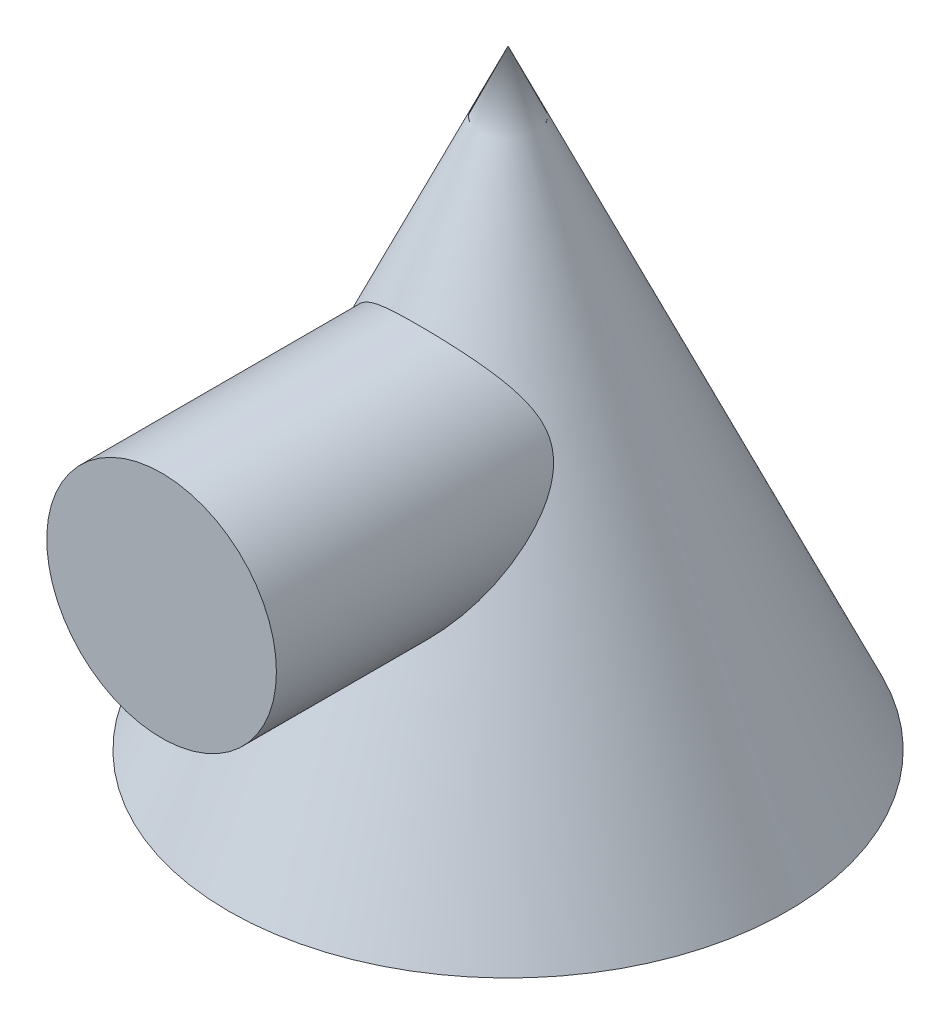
ISO-10303-21;
HEADER;
FILE_DESCRIPTION(('STEP AP214'),'2;1');
FILE_NAME('part.step','',(''),(''),'','','');
FILE_SCHEMA(('AUTOMOTIVE_DESIGN { 1 0 10303 214 1 1 1 1 }'));
ENDSEC;
DATA;
#1=APPLICATION_CONTEXT('core data for automotive mechanical design processes');
#2=APPLICATION_PROTOCOL_DEFINITION('international standard','automotive_design',2000,#1);
#3=PRODUCT_CONTEXT('',#1,'mechanical');
#4=PRODUCT('Part','Part','',(#3));
#5=PRODUCT_RELATED_PRODUCT_CATEGORY('part','',(#4));
#6=PRODUCT_DEFINITION_FORMATION('','',#4);
#7=PRODUCT_DEFINITION_CONTEXT('part definition',#1,'design');
#8=PRODUCT_DEFINITION('design','',#6,#7);
#9=PRODUCT_DEFINITION_SHAPE('','',#8);
#10=(LENGTH_UNIT() NAMED_UNIT(*) SI_UNIT(.MILLI.,.METRE.));
#11=(NAMED_UNIT(*) PLANE_ANGLE_UNIT() SI_UNIT($,.RADIAN.));
#12=(NAMED_UNIT(*) SI_UNIT($,.STERADIAN.) SOLID_ANGLE_UNIT());
#13=UNCERTAINTY_MEASURE_WITH_UNIT(LENGTH_MEASURE(1.E-05),#10,'distance_accuracy_value','');
#14=(GEOMETRIC_REPRESENTATION_CONTEXT(3) GLOBAL_UNCERTAINTY_ASSIGNED_CONTEXT((#13)) GLOBAL_UNIT_ASSIGNED_CONTEXT((#10,
#11,#12)) REPRESENTATION_CONTEXT('',''));
#15=CARTESIAN_POINT('',(0.,0.,0.));
#16=DIRECTION('',(0.,0.,1.));
#17=DIRECTION('',(1.,0.,0.));
#18=AXIS2_PLACEMENT_3D('',#15,#16,#17);
#19=CARTESIAN_POINT('',(0.,41.1300607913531,0.));
#20=DIRECTION('',(0.,-1.,0.));
#21=DIRECTION('',(0.,0.,-1.));
#22=AXIS2_PLACEMENT_3D('',#19,#20,#21);
#23=CONICAL_SURFACE('',#22,0.,0.429775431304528);
#24=CARTESIAN_POINT('',(0.,41.1300607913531,0.));
#25=VERTEX_POINT('',#24);
#26=VERTEX_LOOP('',#25);
#27=FACE_BOUND('',#26,.T.);
#28=CARTESIAN_POINT('',(0.,-13.4134997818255,0.));
#29=DIRECTION('',(0.,1.,0.));
#30=DIRECTION('',(0.,0.,1.));
#31=AXIS2_PLACEMENT_3D('',#28,#29,#30);
#32=CIRCLE('',#31,25.);
#33=CARTESIAN_POINT('',(0.,-13.4134997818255,25.));
#34=VERTEX_POINT('',#33);
#35=EDGE_CURVE('E11',#34,#34,#32,.T.);
#36=ORIENTED_EDGE('',*,*,#35,.T.);
#37=EDGE_LOOP('',(#36));
#38=FACE_BOUND('',#37,.T.);
#39=CARTESIAN_POINT('',(-8.7449974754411,7.88138757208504,12.4806855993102));
#40=CARTESIAN_POINT('',(-8.91898274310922,8.16349470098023,12.2008907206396));
#41=CARTESIAN_POINT('',(-9.07772798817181,8.45139461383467,11.917501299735));
#42=CARTESIAN_POINT('',(-9.3657162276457,9.03761077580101,11.346298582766));
#43=CARTESIAN_POINT('',(-9.49494629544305,9.33593152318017,11.0584834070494));
#44=CARTESIAN_POINT('',(-9.72449222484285,9.94265277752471,10.48097027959));
#45=CARTESIAN_POINT('',(-9.82476298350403,10.2510681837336,10.1912701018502));
#46=CARTESIAN_POINT('',(-9.99606661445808,10.8774010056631,9.6136618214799));
#47=CARTESIAN_POINT('',(-10.0671099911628,11.1953149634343,9.32575311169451));
#48=CARTESIAN_POINT('',(-10.1607347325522,11.7349715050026,8.84958690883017));
#49=CARTESIAN_POINT('',(-10.1915708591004,11.9539052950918,8.65973776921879));
#50=CARTESIAN_POINT('',(-10.2392386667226,12.3968255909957,8.28423786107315));
#51=CARTESIAN_POINT('',(-10.2560725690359,12.6208112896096,8.09858643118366));
#52=CARTESIAN_POINT('',(-10.2749396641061,13.074302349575,7.73373609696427));
#53=CARTESIAN_POINT('',(-10.276985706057,13.3038027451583,7.55453172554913));
#54=CARTESIAN_POINT('',(-10.2651206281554,13.7693187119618,7.20537501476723));
#55=CARTESIAN_POINT('',(-10.2512153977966,14.0053318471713,7.03541928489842));
#56=CARTESIAN_POINT('',(-10.2137542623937,14.4001120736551,6.76672232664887));
#57=CARTESIAN_POINT('',(-10.19535066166,14.5566783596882,6.66405276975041));
#58=CARTESIAN_POINT('',(-10.1505514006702,14.8731625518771,6.46594749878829));
#59=CARTESIAN_POINT('',(-10.1241547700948,15.0330808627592,6.37051266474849));
#60=CARTESIAN_POINT('',(-10.0319274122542,15.5177988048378,6.09818077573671));
#61=CARTESIAN_POINT('',(-9.95298952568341,15.8483738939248,5.93468221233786));
#62=CARTESIAN_POINT('',(-9.81586728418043,16.3127908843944,5.7479987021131));
#63=CARTESIAN_POINT('',(-9.77492610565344,16.4421782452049,5.70048021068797));
#64=CARTESIAN_POINT('',(-9.68688781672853,16.7019825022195,5.61498785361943));
#65=CARTESIAN_POINT('',(-9.63979393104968,16.8323988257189,5.57700901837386));
#66=CARTESIAN_POINT('',(-9.53945802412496,17.0932772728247,5.51165751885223));
#67=CARTESIAN_POINT('',(-9.48622628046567,17.2237389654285,5.48426744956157));
#68=CARTESIAN_POINT('',(-9.37368273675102,17.4839127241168,5.44064464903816));
#69=CARTESIAN_POINT('',(-9.31437101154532,17.6136247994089,5.4244117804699));
#70=CARTESIAN_POINT('',(-9.1899809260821,17.8712260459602,5.40320424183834));
#71=CARTESIAN_POINT('',(-9.12490106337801,17.9991147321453,5.39823251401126));
#72=CARTESIAN_POINT('',(-8.98945655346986,18.2520094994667,5.39907171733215));
#73=CARTESIAN_POINT('',(-8.91909172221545,18.3770154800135,5.40488302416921));
#74=CARTESIAN_POINT('',(-8.77344705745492,18.6235833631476,5.42633720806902));
#75=CARTESIAN_POINT('',(-8.69815744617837,18.7451376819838,5.44200021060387));
#76=CARTESIAN_POINT('',(-8.54325466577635,18.9840329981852,5.48189657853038));
#77=CARTESIAN_POINT('',(-8.46363987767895,19.1013723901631,5.50613317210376));
#78=CARTESIAN_POINT('',(-8.24772940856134,19.4059578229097,5.57977380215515));
#79=CARTESIAN_POINT('',(-8.10807161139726,19.5893442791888,5.63531779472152));
#80=CARTESIAN_POINT('',(-7.81926391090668,19.9436508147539,5.75989771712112));
#81=CARTESIAN_POINT('',(-7.67010671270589,20.1145610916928,5.828944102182));
#82=CARTESIAN_POINT('',(-7.36245236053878,20.444693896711,5.97573195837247));
#83=CARTESIAN_POINT('',(-7.20393023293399,20.6038823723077,6.05349722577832));
#84=CARTESIAN_POINT('',(-6.87814072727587,20.9104516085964,6.21356539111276));
#85=CARTESIAN_POINT('',(-6.71087544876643,21.0578351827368,6.29586719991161));
#86=CARTESIAN_POINT('',(-6.35024400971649,21.3554146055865,6.4702316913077));
#87=CARTESIAN_POINT('',(-6.15594643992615,21.504396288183,6.5624419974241));
#88=CARTESIAN_POINT('',(-5.75664518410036,21.7884897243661,6.74512372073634));
#89=CARTESIAN_POINT('',(-5.55164040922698,21.9236000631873,6.83559495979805));
#90=CARTESIAN_POINT('',(-5.1313602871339,22.1793678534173,7.011758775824));
#91=CARTESIAN_POINT('',(-4.916103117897,22.3000496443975,7.09745926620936));
#92=CARTESIAN_POINT('',(-4.47528149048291,22.5265553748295,7.26171768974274));
#93=CARTESIAN_POINT('',(-4.24971808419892,22.6323808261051,7.34027634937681));
#94=CARTESIAN_POINT('',(-3.80478364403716,22.8215080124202,7.48287625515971));
#95=CARTESIAN_POINT('',(-3.58606209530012,22.9058609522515,7.54754560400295));
#96=CARTESIAN_POINT('',(-3.14093734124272,23.0600765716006,7.66706614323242));
#97=CARTESIAN_POINT('',(-2.91453442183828,23.1299397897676,7.7219176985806));
#98=CARTESIAN_POINT('',(-2.45518584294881,23.2542932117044,7.82031291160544));
#99=CARTESIAN_POINT('',(-2.22224197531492,23.3087875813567,7.86385963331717));
#100=CARTESIAN_POINT('',(-1.75116752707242,23.4016279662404,7.93842984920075));
#101=CARTESIAN_POINT('',(-1.51303700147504,23.4399741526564,7.96945347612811));
#102=CARTESIAN_POINT('',(-1.03206232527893,23.500037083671,8.01818063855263));
#103=CARTESIAN_POINT('',(-0.789200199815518,23.5216670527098,8.03581465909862));
#104=CARTESIAN_POINT('',(-0.301931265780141,23.5475770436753,8.05694922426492));
#105=CARTESIAN_POINT('',(-0.0575244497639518,23.5518569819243,8.06044970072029));
#106=CARTESIAN_POINT('',(0.430730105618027,23.5429875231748,8.05320732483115));
#107=CARTESIAN_POINT('',(0.674577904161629,23.5298400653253,8.0424660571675));
#108=CARTESIAN_POINT('',(1.15970351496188,23.4863617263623,8.00707935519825));
#109=CARTESIAN_POINT('',(1.40098140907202,23.4560313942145,7.98243436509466));
#110=CARTESIAN_POINT('',(1.86063824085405,23.381708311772,7.92241072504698));
#111=CARTESIAN_POINT('',(2.07934731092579,23.3389506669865,7.88800727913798));
#112=CARTESIAN_POINT('',(2.51172654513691,23.2398416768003,7.8088730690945));
#113=CARTESIAN_POINT('',(2.7253970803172,23.1834913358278,7.76414306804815));
#114=CARTESIAN_POINT('',(3.14678815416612,23.0578339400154,7.66539795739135));
#115=CARTESIAN_POINT('',(3.35450593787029,22.9885209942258,7.61137862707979));
#116=CARTESIAN_POINT('',(3.76314690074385,22.8376384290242,7.49529615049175));
#117=CARTESIAN_POINT('',(3.96406862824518,22.7560662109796,7.43323129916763));
#118=CARTESIAN_POINT('',(4.43539146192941,22.547280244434,7.2769283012));
#119=CARTESIAN_POINT('',(4.70237976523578,22.4146630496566,7.17957325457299));
#120=CARTESIAN_POINT('',(5.22136696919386,22.128445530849,6.97596062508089));
#121=CARTESIAN_POINT('',(5.47335850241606,21.9748350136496,6.86969872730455));
#122=CARTESIAN_POINT('',(5.96235790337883,21.647309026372,6.65278027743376));
#123=CARTESIAN_POINT('',(6.19934236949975,21.4733629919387,6.54211727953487));
#124=CARTESIAN_POINT('',(6.65787425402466,21.1055743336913,6.32215652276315));
#125=CARTESIAN_POINT('',(6.87942900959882,20.9117412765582,6.2128581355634));
#126=CARTESIAN_POINT('',(7.22454737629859,20.5823867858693,6.04342566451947));
#127=CARTESIAN_POINT('',(7.35291478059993,20.4532499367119,5.98060401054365));
#128=CARTESIAN_POINT('',(7.60375357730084,20.1869963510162,5.86036638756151));
#129=CARTESIAN_POINT('',(7.72622648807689,20.0498816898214,5.80294902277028));
#130=CARTESIAN_POINT('',(7.96474619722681,19.7677949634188,5.69620697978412));
#131=CARTESIAN_POINT('',(8.08080899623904,19.6228444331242,5.64686148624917));
#132=CARTESIAN_POINT('',(8.30635691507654,19.3247202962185,5.55910704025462));
#133=CARTESIAN_POINT('',(8.41584427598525,19.1715495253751,5.52069434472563));
#134=CARTESIAN_POINT('',(8.60155824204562,18.8958258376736,5.46576518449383));
#135=CARTESIAN_POINT('',(8.67936832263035,18.7749512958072,5.44619086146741));
#136=CARTESIAN_POINT('',(8.83031168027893,18.529197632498,5.41655426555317));
#137=CARTESIAN_POINT('',(8.90344647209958,18.4043198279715,5.406488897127));
#138=CARTESIAN_POINT('',(9.04442644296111,18.1514429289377,5.39702728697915));
#139=CARTESIAN_POINT('',(9.1122794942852,18.023448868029,5.39761484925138));
#140=CARTESIAN_POINT('',(9.24230389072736,17.7651407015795,5.41013415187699));
#141=CARTESIAN_POINT('',(9.30447531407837,17.6348266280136,5.42206573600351));
#142=CARTESIAN_POINT('',(9.42280954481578,17.3728280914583,5.45743392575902));
#143=CARTESIAN_POINT('',(9.47896449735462,17.2411420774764,5.48088535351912));
#144=CARTESIAN_POINT('',(9.58497479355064,16.9776389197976,5.53882203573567));
#145=CARTESIAN_POINT('',(9.63482741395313,16.8458217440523,5.5733120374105));
#146=CARTESIAN_POINT('',(9.77501826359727,16.4511987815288,5.69214414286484));
#147=CARTESIAN_POINT('',(9.85585822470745,16.1895156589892,5.79180586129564));
#148=CARTESIAN_POINT('',(9.97867757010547,15.7308652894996,5.99645983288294));
#149=CARTESIAN_POINT('',(10.025292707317,15.532312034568,6.09546938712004));
#150=CARTESIAN_POINT('',(10.1056049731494,15.1401648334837,6.30777471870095));
#151=CARTESIAN_POINT('',(10.1392936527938,14.9465742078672,6.4210797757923));
#152=CARTESIAN_POINT('',(10.1950315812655,14.5638892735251,6.6586600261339));
#153=CARTESIAN_POINT('',(10.2170491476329,14.3748085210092,6.78296402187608));
#154=CARTESIAN_POINT('',(10.2503941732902,14.0011513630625,7.03960306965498));
#155=CARTESIAN_POINT('',(10.2617174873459,13.8165767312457,7.1719412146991));
#156=CARTESIAN_POINT('',(10.2742066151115,13.4596840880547,7.43651984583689));
#157=CARTESIAN_POINT('',(10.2758036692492,13.2871869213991,7.56850049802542));
#158=CARTESIAN_POINT('',(10.2705351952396,12.9455340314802,7.83657552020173));
#159=CARTESIAN_POINT('',(10.2636681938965,12.7763788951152,7.97267060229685));
#160=CARTESIAN_POINT('',(10.2309973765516,12.2732449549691,8.38567169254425));
#161=CARTESIAN_POINT('',(10.1931188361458,11.9437617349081,8.66716925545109));
#162=CARTESIAN_POINT('',(10.0871750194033,11.2947947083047,9.2366543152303));
#163=CARTESIAN_POINT('',(10.0190681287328,10.9753253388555,9.52465023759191));
#164=CARTESIAN_POINT('',(9.85353726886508,10.3461350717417,10.1026497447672));
#165=CARTESIAN_POINT('',(9.75612231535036,10.0364112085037,10.3926526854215));
#166=CARTESIAN_POINT('',(9.52383959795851,9.40417498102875,10.9927829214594));
#167=CARTESIAN_POINT('',(9.38674599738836,9.08239489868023,11.3028233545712));
#168=CARTESIAN_POINT('',(9.07826275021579,8.45063988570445,11.9180859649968));
#169=CARTESIAN_POINT('',(8.90686393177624,8.14066813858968,12.2233068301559));
#170=CARTESIAN_POINT('',(8.52905815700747,7.53491876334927,12.8245720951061));
#171=CARTESIAN_POINT('',(8.32272807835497,7.23911175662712,13.1206349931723));
#172=CARTESIAN_POINT('',(7.87333845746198,6.66361169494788,13.7001444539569));
#173=CARTESIAN_POINT('',(7.63029945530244,6.38390974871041,13.9835979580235));
#174=CARTESIAN_POINT('',(7.1991533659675,5.94029395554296,14.4352622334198));
#175=CARTESIAN_POINT('',(7.02229939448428,5.77061285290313,14.6085704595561));
#176=CARTESIAN_POINT('',(6.65225147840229,5.44068532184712,14.9464167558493));
#177=CARTESIAN_POINT('',(6.45905570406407,5.28043995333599,15.1109538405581));
#178=CARTESIAN_POINT('',(5.85456015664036,4.81632521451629,15.5885266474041));
#179=CARTESIAN_POINT('',(5.41767152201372,4.52836116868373,15.8862549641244));
#180=CARTESIAN_POINT('',(4.76070540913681,4.16733795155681,16.2605608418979));
#181=CARTESIAN_POINT('',(4.56820299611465,4.06916533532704,16.3624774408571));
#182=CARTESIAN_POINT('',(4.17298184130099,3.88340574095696,16.5555149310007));
#183=CARTESIAN_POINT('',(3.9702682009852,3.79581354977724,16.6466411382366));
#184=CARTESIAN_POINT('',(3.55521837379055,3.63246321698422,16.8167220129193));
#185=CARTESIAN_POINT('',(3.34288375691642,3.55670315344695,16.8956786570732));
#186=CARTESIAN_POINT('',(2.90947795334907,3.41826898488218,17.0400480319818));
#187=CARTESIAN_POINT('',(2.68840669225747,3.35559499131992,17.1054606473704));
#188=CARTESIAN_POINT('',(2.23671661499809,3.24403363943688,17.2219534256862));
#189=CARTESIAN_POINT('',(2.00602703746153,3.1952829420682,17.2728914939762));
#190=CARTESIAN_POINT('',(1.53887356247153,3.11346832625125,17.358404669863));
#191=CARTESIAN_POINT('',(1.30240964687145,3.08040445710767,17.3929797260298));
#192=CARTESIAN_POINT('',(0.826044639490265,3.03079986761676,17.4448597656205));
#193=CARTESIAN_POINT('',(0.58614622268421,3.01424692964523,17.4621775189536));
#194=CARTESIAN_POINT('',(0.105171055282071,2.99805907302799,17.4791132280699));
#195=CARTESIAN_POINT('',(-0.135905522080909,2.99842173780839,17.4787337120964));
#196=CARTESIAN_POINT('',(-0.581338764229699,3.01474320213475,17.4616584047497));
#197=CARTESIAN_POINT('',(-0.785880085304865,3.02839981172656,17.4473711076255));
#198=CARTESIAN_POINT('',(-1.19252929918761,3.06773505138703,17.4062294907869));
#199=CARTESIAN_POINT('',(-1.39463718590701,3.09341371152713,17.3793751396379));
#200=CARTESIAN_POINT('',(-1.79503047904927,3.15632631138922,17.3136058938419));
#201=CARTESIAN_POINT('',(-1.99331604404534,3.19355977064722,17.2746915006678));
#202=CARTESIAN_POINT('',(-2.3849051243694,3.27895355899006,17.1854851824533));
#203=CARTESIAN_POINT('',(-2.57820836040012,3.32711449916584,17.1351926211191));
#204=CARTESIAN_POINT('',(-2.96116294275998,3.43426889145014,17.0233620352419));
#205=CARTESIAN_POINT('',(-3.15074189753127,3.49338625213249,16.9616954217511));
#206=CARTESIAN_POINT('',(-3.52306698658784,3.62123710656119,16.8284279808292));
#207=CARTESIAN_POINT('',(-3.70581110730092,3.68997340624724,16.7568242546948));
#208=CARTESIAN_POINT('',(-4.24293189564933,3.90935738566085,16.5284820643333));
#209=CARTESIAN_POINT('',(-4.58624370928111,4.07319353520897,16.3581985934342));
#210=CARTESIAN_POINT('',(-5.42149301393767,4.52800077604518,15.8865862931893));
#211=CARTESIAN_POINT('',(-5.89090097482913,4.83923758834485,15.5647971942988));
#212=CARTESIAN_POINT('',(-6.53631986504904,5.34286316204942,15.0468150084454));
#213=CARTESIAN_POINT('',(-6.74188041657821,5.51708901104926,14.8680445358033));
#214=CARTESIAN_POINT('',(-7.13408537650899,5.87618014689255,14.5006949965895));
#215=CARTESIAN_POINT('',(-7.32073425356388,6.06104290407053,14.3121182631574));
#216=CARTESIAN_POINT('',(-7.73897876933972,6.50749396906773,13.8583195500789));
#217=CARTESIAN_POINT('',(-7.96284636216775,6.77292159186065,13.5897598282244));
#218=CARTESIAN_POINT('',(-8.37797305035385,7.31739978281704,13.042245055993));
#219=CARTESIAN_POINT('',(-8.56925956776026,7.59643863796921,12.7632989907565));
#220=CARTESIAN_POINT('',(-8.7449974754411,7.88138757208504,12.4806855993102));
#221=B_SPLINE_CURVE_WITH_KNOTS('',3,(#39,#40,#41,#42,#43,#44,#45,#46,#47,#48,#49,#50,#51,#52,
#53,#54,#55,#56,#57,#58,#59,#60,#61,#62,#63,#64,#65,#66,#67,#68,#69,#70,#71,#72,#73,#74,#75,#76,
#77,#78,#79,#80,#81,#82,#83,#84,#85,#86,#87,#88,#89,#90,#91,#92,#93,#94,#95,#96,#97,#98,#99,
#100,#101,#102,#103,#104,#105,#106,#107,#108,#109,#110,#111,#112,#113,#114,#115,#116,#117,#118,
#119,#120,#121,#122,#123,#124,#125,#126,#127,#128,#129,#130,#131,#132,#133,#134,#135,#136,#137,
#138,#139,#140,#141,#142,#143,#144,#145,#146,#147,#148,#149,#150,#151,#152,#153,#154,#155,#156,
#157,#158,#159,#160,#161,#162,#163,#164,#165,#166,#167,#168,#169,#170,#171,#172,#173,#174,#175,
#176,#177,#178,#179,#180,#181,#182,#183,#184,#185,#186,#187,#188,#189,#190,#191,#192,#193,#194,
#195,#196,#197,#198,#199,#200,#201,#202,#203,#204,#205,#206,#207,#208,#209,#210,#211,#212,#213,
#214,#215,#216,#217,#218,#219,#220),.UNSPECIFIED.,.T.,.F.,(4,2,2,2,2,2,2,2,2,2,2,2,2,2,2,2,2,2,
2,2,2,2,2,2,2,2,2,2,2,2,2,2,2,2,2,2,2,2,2,2,2,2,2,2,2,2,2,2,2,2,2,2,2,2,2,2,2,2,2,2,2,2,2,2,2,2,
2,2,2,2,2,2,2,2,2,2,2,2,2,2,2,2,2,2,2,2,2,2,2,2,4),(0.,1.3009322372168,2.60243314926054,
3.90595029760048,5.20899854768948,6.0829079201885,6.95667863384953,7.82969003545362,
8.70237920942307,9.26643113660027,9.83055156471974,10.9558184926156,11.3868350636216,
11.8176266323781,12.2477070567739,12.6777821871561,13.1079696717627,13.5381721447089,
13.9692563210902,14.4005029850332,15.1106075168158,15.8212640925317,16.5339097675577,
17.2463850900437,18.030681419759,18.8150576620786,19.5980914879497,20.3810455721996,
21.109886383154,21.8387000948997,22.5673160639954,23.2959243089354,24.0282898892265,
24.7606590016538,25.492946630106,26.2252108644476,26.900960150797,27.5766595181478,
28.252666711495,28.9288174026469,29.8682754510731,30.808191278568,31.7495384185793,
32.6904348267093,33.2680162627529,33.8454481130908,34.4213666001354,34.9970876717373,
35.4319429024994,35.8666565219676,36.3007092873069,36.7347560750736,37.16936280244,
37.6041566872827,38.4747063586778,39.15397677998,39.8336904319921,40.5152399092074,
41.1970534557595,41.8484029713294,42.4998658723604,43.8034073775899,45.1087490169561,
46.413689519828,47.8145045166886,49.2156945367,50.6138399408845,52.0112059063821,
52.9110257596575,53.8109464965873,55.6071311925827,56.3233781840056,57.0392708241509,
57.7550470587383,58.4708293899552,59.1934131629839,59.9159992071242,60.6380501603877,
61.3599979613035,61.9757402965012,62.5914841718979,63.2072024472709,63.8229551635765,
64.4461512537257,65.0695295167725,66.3161357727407,68.2506652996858,69.2201692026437,
70.189443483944,71.5045930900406,72.8186302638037),.UNSPECIFIED.);
#222=CARTESIAN_POINT('',(-8.7449974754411,7.88138757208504,12.4806855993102));
#223=VERTEX_POINT('',#222);
#224=EDGE_CURVE('E34',#223,#223,#221,.T.);
#225=ORIENTED_EDGE('',*,*,#224,.T.);
#226=EDGE_LOOP('',(#225));
#227=FACE_BOUND('',#226,.T.);
#228=ADVANCED_FACE('F30',(#27,#38,#227),#23,.T.);
#229=CARTESIAN_POINT('',(-25.,-13.4134997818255,0.));
#230=DIRECTION('',(0.,-1.,0.));
#231=DIRECTION('',(0.,0.,-1.));
#232=AXIS2_PLACEMENT_3D('',#229,#230,#231);
#233=PLANE('',#232);
#234=ORIENTED_EDGE('',*,*,#35,.F.);
#235=EDGE_LOOP('',(#234));
#236=FACE_BOUND('',#235,.T.);
#237=ADVANCED_FACE('F45',(#236),#233,.T.);
#238=CARTESIAN_POINT('',(0.,13.2747269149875,31.));
#239=DIRECTION('',(0.,0.,-1.));
#240=DIRECTION('',(-1.,0.,0.));
#241=AXIS2_PLACEMENT_3D('',#238,#239,#240);
#242=CYLINDRICAL_SURFACE('',#241,10.2743900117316);
#243=ORIENTED_EDGE('',*,*,#224,.F.);
#244=EDGE_LOOP('',(#243));
#245=FACE_BOUND('',#244,.T.);
#246=CARTESIAN_POINT('',(0.,13.2747269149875,31.));
#247=DIRECTION('',(0.,0.,1.));
#248=DIRECTION('',(1.,0.,0.));
#249=AXIS2_PLACEMENT_3D('',#246,#247,#248);
#250=CIRCLE('',#249,10.2743900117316);
#251=CARTESIAN_POINT('',(10.2743900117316,13.2747269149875,31.));
#252=VERTEX_POINT('',#251);
#253=EDGE_CURVE('E51',#252,#252,#250,.T.);
#254=ORIENTED_EDGE('',*,*,#253,.F.);
#255=EDGE_LOOP('',(#254));
#256=FACE_BOUND('',#255,.T.);
#257=ADVANCED_FACE('F58',(#245,#256),#242,.T.);
#258=CARTESIAN_POINT('',(0.,13.2747269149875,31.));
#259=DIRECTION('',(0.,0.,1.));
#260=DIRECTION('',(1.,0.,0.));
#261=AXIS2_PLACEMENT_3D('',#258,#259,#260);
#262=PLANE('',#261);
#263=ORIENTED_EDGE('',*,*,#253,.T.);
#264=EDGE_LOOP('',(#263));
#265=FACE_BOUND('',#264,.T.);
#266=ADVANCED_FACE('F56',(#265),#262,.T.);
#267=CLOSED_SHELL('',(#228,#237,#257,#266));
#268=MANIFOLD_SOLID_BREP('B2',#267);
#269=ADVANCED_BREP_SHAPE_REPRESENTATION('',(#18,#268),#14);
#270=SHAPE_DEFINITION_REPRESENTATION(#9,#269);
ENDSEC;
END-ISO-10303-21;
